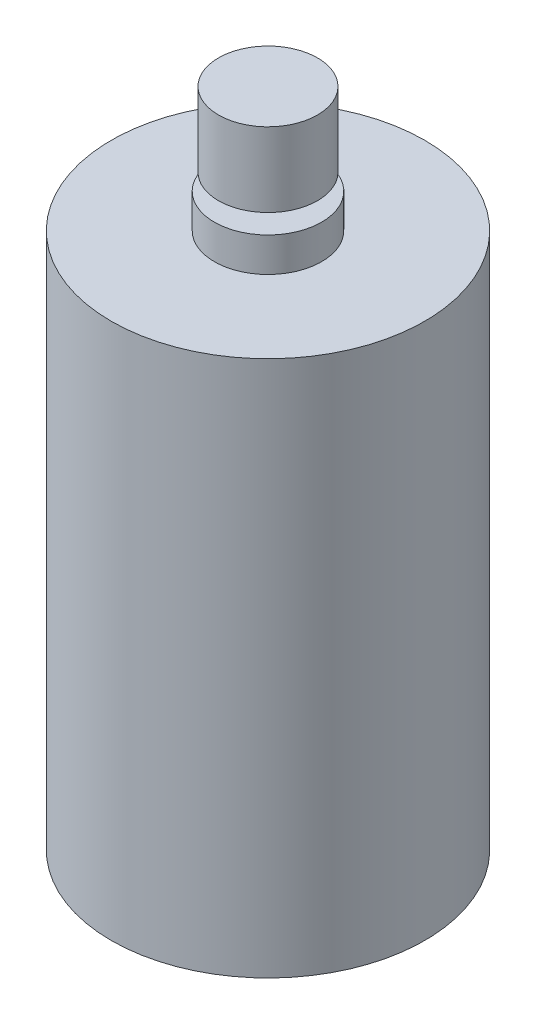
ISO-10303-21;
HEADER;
FILE_DESCRIPTION(('STEP AP214'),'2;1');
FILE_NAME('part.step','',(''),(''),'','','');
FILE_SCHEMA(('AUTOMOTIVE_DESIGN { 1 0 10303 214 1 1 1 1 }'));
ENDSEC;
DATA;
#1=APPLICATION_CONTEXT('core data for automotive mechanical design processes');
#2=APPLICATION_PROTOCOL_DEFINITION('international standard','automotive_design',2000,#1);
#3=PRODUCT_CONTEXT('',#1,'mechanical');
#4=PRODUCT('Part','Part','',(#3));
#5=PRODUCT_RELATED_PRODUCT_CATEGORY('part','',(#4));
#6=PRODUCT_DEFINITION_FORMATION('','',#4);
#7=PRODUCT_DEFINITION_CONTEXT('part definition',#1,'design');
#8=PRODUCT_DEFINITION('design','',#6,#7);
#9=PRODUCT_DEFINITION_SHAPE('','',#8);
#10=(LENGTH_UNIT() NAMED_UNIT(*) SI_UNIT(.MILLI.,.METRE.));
#11=(NAMED_UNIT(*) PLANE_ANGLE_UNIT() SI_UNIT($,.RADIAN.));
#12=(NAMED_UNIT(*) SI_UNIT($,.STERADIAN.) SOLID_ANGLE_UNIT());
#13=UNCERTAINTY_MEASURE_WITH_UNIT(LENGTH_MEASURE(1.E-05),#10,'distance_accuracy_value','');
#14=(GEOMETRIC_REPRESENTATION_CONTEXT(3) GLOBAL_UNCERTAINTY_ASSIGNED_CONTEXT((#13)) GLOBAL_UNIT_ASSIGNED_CONTEXT((#10,
#11,#12)) REPRESENTATION_CONTEXT('',''));
#15=CARTESIAN_POINT('',(0.,0.,0.));
#16=DIRECTION('',(0.,0.,1.));
#17=DIRECTION('',(1.,0.,0.));
#18=AXIS2_PLACEMENT_3D('',#15,#16,#17);
#19=CARTESIAN_POINT('',(0.,69.15,0.));
#20=DIRECTION('',(0.,1.,0.));
#21=DIRECTION('',(0.,0.,1.));
#22=AXIS2_PLACEMENT_3D('',#19,#20,#21);
#23=PLANE('',#22);
#24=CARTESIAN_POINT('',(0.,69.15,0.));
#25=DIRECTION('',(0.,1.,0.));
#26=DIRECTION('',(0.,0.,1.));
#27=AXIS2_PLACEMENT_3D('',#24,#25,#26);
#28=CIRCLE('',#27,6.5);
#29=CARTESIAN_POINT('',(0.,69.15,-6.5));
#30=VERTEX_POINT('',#29);
#31=EDGE_CURVE('E41',#30,#30,#28,.T.);
#32=ORIENTED_EDGE('',*,*,#31,.T.);
#33=EDGE_LOOP('',(#32));
#34=FACE_BOUND('',#33,.T.);
#35=CARTESIAN_POINT('',(0.,69.15,0.));
#36=DIRECTION('',(0.,1.,0.));
#37=DIRECTION('',(0.,0.,1.));
#38=AXIS2_PLACEMENT_3D('',#35,#36,#37);
#39=CIRCLE('',#38,1.);
#40=CARTESIAN_POINT('',(0.,69.15,1.));
#41=VERTEX_POINT('',#40);
#42=EDGE_CURVE('E49',#41,#41,#39,.T.);
#43=ORIENTED_EDGE('',*,*,#42,.F.);
#44=EDGE_LOOP('',(#43));
#45=FACE_BOUND('',#44,.T.);
#46=ADVANCED_FACE('F30',(#34,#45),#23,.T.);
#47=CARTESIAN_POINT('',(0.,65.,0.));
#48=DIRECTION('',(0.,1.,0.));
#49=DIRECTION('',(0.,0.,1.));
#50=AXIS2_PLACEMENT_3D('',#47,#48,#49);
#51=PLANE('',#50);
#52=CARTESIAN_POINT('',(0.,65.,0.));
#53=DIRECTION('',(0.,1.,0.));
#54=DIRECTION('',(0.,0.,1.));
#55=AXIS2_PLACEMENT_3D('',#52,#53,#54);
#56=CIRCLE('',#55,19.);
#57=CARTESIAN_POINT('',(0.,65.,19.));
#58=VERTEX_POINT('',#57);
#59=EDGE_CURVE('E10',#58,#58,#56,.T.);
#60=ORIENTED_EDGE('',*,*,#59,.T.);
#61=EDGE_LOOP('',(#60));
#62=FACE_BOUND('',#61,.T.);
#63=CARTESIAN_POINT('',(0.,65.,0.));
#64=DIRECTION('',(0.,1.,0.));
#65=DIRECTION('',(0.,0.,1.));
#66=AXIS2_PLACEMENT_3D('',#63,#64,#65);
#67=CIRCLE('',#66,6.5);
#68=CARTESIAN_POINT('',(0.,65.,-6.5));
#69=VERTEX_POINT('',#68);
#70=EDGE_CURVE('E43',#69,#69,#67,.T.);
#71=ORIENTED_EDGE('',*,*,#70,.F.);
#72=EDGE_LOOP('',(#71));
#73=FACE_BOUND('',#72,.T.);
#74=ADVANCED_FACE('F83',(#62,#73),#51,.T.);
#75=CARTESIAN_POINT('',(0.,65.,0.));
#76=DIRECTION('',(0.,-1.,0.));
#77=DIRECTION('',(0.,0.,-1.));
#78=AXIS2_PLACEMENT_3D('',#75,#76,#77);
#79=CYLINDRICAL_SURFACE('',#78,19.);
#80=ORIENTED_EDGE('',*,*,#59,.F.);
#81=EDGE_LOOP('',(#80));
#82=FACE_BOUND('',#81,.T.);
#83=CARTESIAN_POINT('',(0.,0.,0.));
#84=DIRECTION('',(0.,1.,0.));
#85=DIRECTION('',(0.,0.,1.));
#86=AXIS2_PLACEMENT_3D('',#83,#84,#85);
#87=CIRCLE('',#86,19.);
#88=CARTESIAN_POINT('',(0.,0.,19.));
#89=VERTEX_POINT('',#88);
#90=EDGE_CURVE('E34',#89,#89,#87,.T.);
#91=ORIENTED_EDGE('',*,*,#90,.T.);
#92=EDGE_LOOP('',(#91));
#93=FACE_BOUND('',#92,.T.);
#94=ADVANCED_FACE('F32',(#82,#93),#79,.T.);
#95=CARTESIAN_POINT('',(0.,0.,0.));
#96=DIRECTION('',(0.,1.,0.));
#97=DIRECTION('',(0.,0.,1.));
#98=AXIS2_PLACEMENT_3D('',#95,#96,#97);
#99=PLANE('',#98);
#100=ORIENTED_EDGE('',*,*,#90,.F.);
#101=EDGE_LOOP('',(#100));
#102=FACE_BOUND('',#101,.T.);
#103=ADVANCED_FACE('F92',(#102),#99,.F.);
#104=CARTESIAN_POINT('',(0.,69.15,0.));
#105=DIRECTION('',(0.,-1.,0.));
#106=DIRECTION('',(0.,0.,-1.));
#107=AXIS2_PLACEMENT_3D('',#104,#105,#106);
#108=CYLINDRICAL_SURFACE('',#107,6.5);
#109=CARTESIAN_POINT('',(0.,69.15,-6.5));
#110=CARTESIAN_POINT('',(0.,69.1067708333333,-6.5));
#111=CARTESIAN_POINT('',(0.,69.0635416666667,-6.5));
#112=CARTESIAN_POINT('',(0.,68.9770833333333,-6.5));
#113=CARTESIAN_POINT('',(0.,68.9338541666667,-6.5));
#114=CARTESIAN_POINT('',(0.,68.8473958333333,-6.5));
#115=CARTESIAN_POINT('',(0.,68.8041666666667,-6.5));
#116=CARTESIAN_POINT('',(0.,68.7177083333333,-6.5));
#117=CARTESIAN_POINT('',(0.,68.6744791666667,-6.5));
#118=CARTESIAN_POINT('',(0.,68.5880208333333,-6.5));
#119=CARTESIAN_POINT('',(0.,68.5447916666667,-6.5));
#120=CARTESIAN_POINT('',(0.,68.4583333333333,-6.5));
#121=CARTESIAN_POINT('',(0.,68.4151041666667,-6.5));
#122=CARTESIAN_POINT('',(0.,68.3286458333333,-6.5));
#123=CARTESIAN_POINT('',(0.,68.2854166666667,-6.5));
#124=CARTESIAN_POINT('',(0.,68.1989583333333,-6.5));
#125=CARTESIAN_POINT('',(0.,68.1557291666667,-6.5));
#126=CARTESIAN_POINT('',(0.,68.0692708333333,-6.5));
#127=CARTESIAN_POINT('',(0.,68.0260416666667,-6.5));
#128=CARTESIAN_POINT('',(0.,67.9395833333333,-6.5));
#129=CARTESIAN_POINT('',(0.,67.8963541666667,-6.5));
#130=CARTESIAN_POINT('',(0.,67.8098958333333,-6.5));
#131=CARTESIAN_POINT('',(0.,67.7666666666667,-6.5));
#132=CARTESIAN_POINT('',(0.,67.6802083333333,-6.5));
#133=CARTESIAN_POINT('',(0.,67.6369791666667,-6.5));
#134=CARTESIAN_POINT('',(0.,67.5505208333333,-6.5));
#135=CARTESIAN_POINT('',(0.,67.5072916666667,-6.5));
#136=CARTESIAN_POINT('',(0.,67.4208333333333,-6.5));
#137=CARTESIAN_POINT('',(0.,67.3776041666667,-6.5));
#138=CARTESIAN_POINT('',(0.,67.2911458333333,-6.5));
#139=CARTESIAN_POINT('',(0.,67.2479166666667,-6.5));
#140=CARTESIAN_POINT('',(0.,67.1614583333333,-6.5));
#141=CARTESIAN_POINT('',(0.,67.1182291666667,-6.5));
#142=CARTESIAN_POINT('',(0.,67.0317708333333,-6.5));
#143=CARTESIAN_POINT('',(0.,66.9885416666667,-6.5));
#144=CARTESIAN_POINT('',(0.,66.9020833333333,-6.5));
#145=CARTESIAN_POINT('',(0.,66.8588541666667,-6.5));
#146=CARTESIAN_POINT('',(0.,66.7723958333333,-6.5));
#147=CARTESIAN_POINT('',(0.,66.7291666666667,-6.5));
#148=CARTESIAN_POINT('',(0.,66.6427083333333,-6.5));
#149=CARTESIAN_POINT('',(0.,66.5994791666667,-6.5));
#150=CARTESIAN_POINT('',(0.,66.5130208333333,-6.5));
#151=CARTESIAN_POINT('',(0.,66.4697916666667,-6.5));
#152=CARTESIAN_POINT('',(0.,66.3833333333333,-6.5));
#153=CARTESIAN_POINT('',(0.,66.3401041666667,-6.5));
#154=CARTESIAN_POINT('',(0.,66.2536458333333,-6.5));
#155=CARTESIAN_POINT('',(0.,66.2104166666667,-6.5));
#156=CARTESIAN_POINT('',(0.,66.1239583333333,-6.5));
#157=CARTESIAN_POINT('',(0.,66.0807291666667,-6.5));
#158=CARTESIAN_POINT('',(0.,65.9942708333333,-6.5));
#159=CARTESIAN_POINT('',(0.,65.9510416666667,-6.5));
#160=CARTESIAN_POINT('',(0.,65.8645833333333,-6.5));
#161=CARTESIAN_POINT('',(0.,65.8213541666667,-6.5));
#162=CARTESIAN_POINT('',(0.,65.7348958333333,-6.5));
#163=CARTESIAN_POINT('',(0.,65.6916666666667,-6.5));
#164=CARTESIAN_POINT('',(0.,65.6052083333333,-6.5));
#165=CARTESIAN_POINT('',(0.,65.5619791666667,-6.5));
#166=CARTESIAN_POINT('',(0.,65.4755208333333,-6.5));
#167=CARTESIAN_POINT('',(0.,65.4322916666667,-6.5));
#168=CARTESIAN_POINT('',(0.,65.3458333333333,-6.5));
#169=CARTESIAN_POINT('',(0.,65.3026041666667,-6.5));
#170=CARTESIAN_POINT('',(0.,65.2161458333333,-6.5));
#171=CARTESIAN_POINT('',(0.,65.1729166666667,-6.5));
#172=CARTESIAN_POINT('',(0.,65.0864583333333,-6.5));
#173=CARTESIAN_POINT('',(0.,65.0432291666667,-6.5));
#174=CARTESIAN_POINT('',(0.,65.,-6.5));
#175=B_SPLINE_CURVE_WITH_KNOTS('',3,(#109,#110,#111,#112,#113,#114,#115,#116,#117,#118,#119,
#120,#121,#122,#123,#124,#125,#126,#127,#128,#129,#130,#131,#132,#133,#134,#135,#136,#137,#138,
#139,#140,#141,#142,#143,#144,#145,#146,#147,#148,#149,#150,#151,#152,#153,#154,#155,#156,#157,
#158,#159,#160,#161,#162,#163,#164,#165,#166,#167,#168,#169,#170,#171,#172,#173,#174),
.UNSPECIFIED.,.F.,.F.,(4,2,2,2,2,2,2,2,2,2,2,2,2,2,2,2,2,2,2,2,2,2,2,2,2,2,2,2,2,2,2,2,4),(0.,
0.129687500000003,0.259375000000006,0.389062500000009,0.518750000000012,0.648437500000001,
0.778125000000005,0.907812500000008,1.03750000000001,1.16718750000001,1.296875,1.42656250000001,
1.55625000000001,1.68593750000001,1.815625,1.9453125,2.07500000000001,2.20468750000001,
2.33437500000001,2.4640625,2.59375000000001,2.72343750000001,2.85312500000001,2.98281250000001,
3.1125,3.24218750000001,3.37187500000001,3.50156250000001,3.63125,3.76093750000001,
3.89062500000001,4.02031250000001,4.15000000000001),.UNSPECIFIED.);
#176=EDGE_CURVE('BSEAM78',#30,#69,#175,.T.);
#177=ORIENTED_EDGE('',*,*,#31,.F.);
#178=ORIENTED_EDGE('',*,*,#70,.T.);
#179=ORIENTED_EDGE('',*,*,#176,.T.);
#180=ORIENTED_EDGE('',*,*,#176,.F.);
#181=EDGE_LOOP('',(#177,#179,#178,#180));
#182=FACE_BOUND('',#181,.T.);
#183=ADVANCED_FACE('F78',(#182),#108,.T.);
#184=CARTESIAN_POINT('',(0.,71.15,0.));
#185=DIRECTION('',(0.,-1.,0.));
#186=DIRECTION('',(0.,0.,-1.));
#187=AXIS2_PLACEMENT_3D('',#184,#185,#186);
#188=CYLINDRICAL_SURFACE('',#187,1.);
#189=CARTESIAN_POINT('',(0.,71.15,0.));
#190=DIRECTION('',(0.,1.,0.));
#191=DIRECTION('',(0.,0.,1.));
#192=AXIS2_PLACEMENT_3D('',#189,#190,#191);
#193=CIRCLE('',#192,1.);
#194=CARTESIAN_POINT('',(0.,71.15,1.));
#195=VERTEX_POINT('',#194);
#196=EDGE_CURVE('E46',#195,#195,#193,.T.);
#197=ORIENTED_EDGE('',*,*,#196,.F.);
#198=EDGE_LOOP('',(#197));
#199=FACE_BOUND('',#198,.T.);
#200=ORIENTED_EDGE('',*,*,#42,.T.);
#201=EDGE_LOOP('',(#200));
#202=FACE_BOUND('',#201,.T.);
#203=ADVANCED_FACE('F72',(#199,#202),#188,.T.);
#204=CARTESIAN_POINT('',(0.,71.15,0.));
#205=DIRECTION('',(0.,1.,0.));
#206=DIRECTION('',(0.,0.,1.));
#207=AXIS2_PLACEMENT_3D('',#204,#205,#206);
#208=PLANE('',#207);
#209=CARTESIAN_POINT('',(0.,71.15,0.));
#210=DIRECTION('',(0.,1.,0.));
#211=DIRECTION('',(0.,0.,1.));
#212=AXIS2_PLACEMENT_3D('',#209,#210,#211);
#213=CIRCLE('',#212,6.);
#214=CARTESIAN_POINT('',(0.,71.15,6.));
#215=VERTEX_POINT('',#214);
#216=EDGE_CURVE('E55',#215,#215,#213,.T.);
#217=ORIENTED_EDGE('',*,*,#216,.F.);
#218=EDGE_LOOP('',(#217));
#219=FACE_BOUND('',#218,.T.);
#220=ORIENTED_EDGE('',*,*,#196,.T.);
#221=EDGE_LOOP('',(#220));
#222=FACE_BOUND('',#221,.T.);
#223=ADVANCED_FACE('F66',(#219,#222),#208,.F.);
#224=CARTESIAN_POINT('',(0.,80.15,0.));
#225=DIRECTION('',(0.,-1.,0.));
#226=DIRECTION('',(0.,0.,-1.));
#227=AXIS2_PLACEMENT_3D('',#224,#225,#226);
#228=CYLINDRICAL_SURFACE('',#227,6.);
#229=CARTESIAN_POINT('',(0.,80.15,0.));
#230=DIRECTION('',(0.,1.,0.));
#231=DIRECTION('',(0.,0.,1.));
#232=AXIS2_PLACEMENT_3D('',#229,#230,#231);
#233=CIRCLE('',#232,6.);
#234=CARTESIAN_POINT('',(0.,80.15,6.));
#235=VERTEX_POINT('',#234);
#236=EDGE_CURVE('E52',#235,#235,#233,.T.);
#237=ORIENTED_EDGE('',*,*,#236,.F.);
#238=EDGE_LOOP('',(#237));
#239=FACE_BOUND('',#238,.T.);
#240=ORIENTED_EDGE('',*,*,#216,.T.);
#241=EDGE_LOOP('',(#240));
#242=FACE_BOUND('',#241,.T.);
#243=ADVANCED_FACE('F63',(#239,#242),#228,.T.);
#244=CARTESIAN_POINT('',(0.,80.15,0.));
#245=DIRECTION('',(0.,1.,0.));
#246=DIRECTION('',(0.,0.,1.));
#247=AXIS2_PLACEMENT_3D('',#244,#245,#246);
#248=PLANE('',#247);
#249=ORIENTED_EDGE('',*,*,#236,.T.);
#250=EDGE_LOOP('',(#249));
#251=FACE_BOUND('',#250,.T.);
#252=ADVANCED_FACE('F61',(#251),#248,.T.);
#253=CLOSED_SHELL('',(#46,#74,#94,#103,#183,#203,#223,#243,#252));
#254=MANIFOLD_SOLID_BREP('B2',#253);
#255=ADVANCED_BREP_SHAPE_REPRESENTATION('',(#18,#254),#14);
#256=SHAPE_DEFINITION_REPRESENTATION(#9,#255);
ENDSEC;
END-ISO-10303-21;
